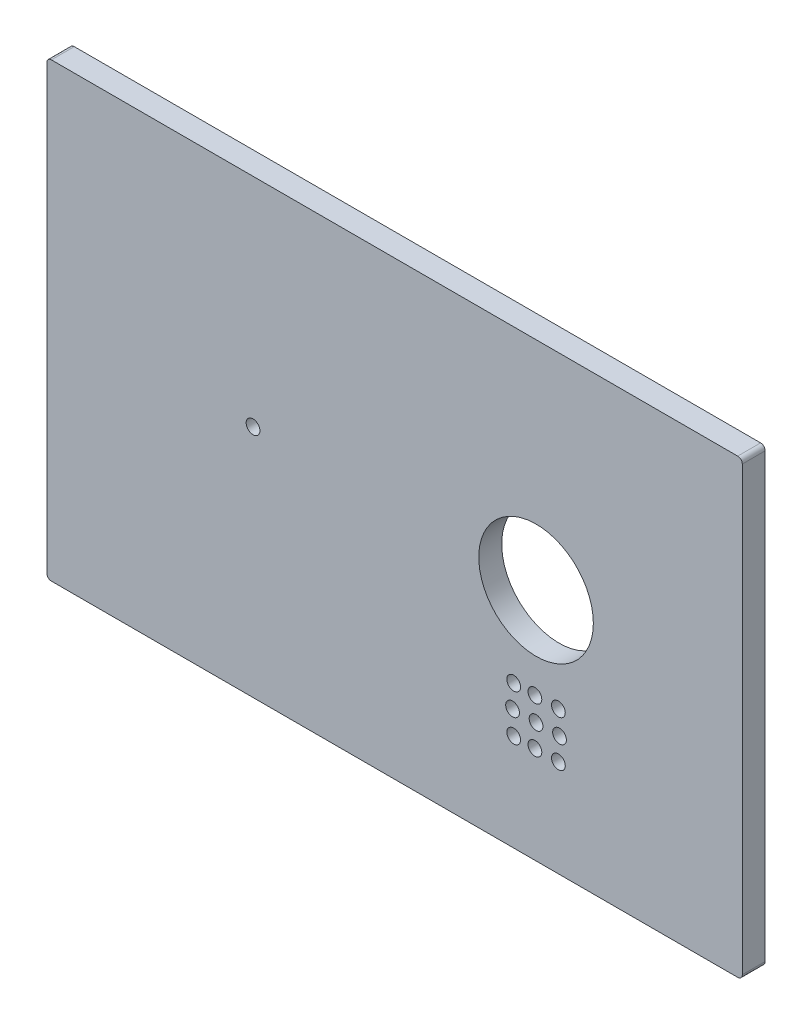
ISO-10303-21;
HEADER;
FILE_DESCRIPTION(('STEP AP214'),'2;1');
FILE_NAME('part.step','',(''),(''),'','','');
FILE_SCHEMA(('AUTOMOTIVE_DESIGN { 1 0 10303 214 1 1 1 1 }'));
ENDSEC;
DATA;
#1=APPLICATION_CONTEXT('core data for automotive mechanical design processes');
#2=APPLICATION_PROTOCOL_DEFINITION('international standard','automotive_design',2000,#1);
#3=PRODUCT_CONTEXT('',#1,'mechanical');
#4=PRODUCT('Part','Part','',(#3));
#5=PRODUCT_RELATED_PRODUCT_CATEGORY('part','',(#4));
#6=PRODUCT_DEFINITION_FORMATION('','',#4);
#7=PRODUCT_DEFINITION_CONTEXT('part definition',#1,'design');
#8=PRODUCT_DEFINITION('design','',#6,#7);
#9=PRODUCT_DEFINITION_SHAPE('','',#8);
#10=(LENGTH_UNIT() NAMED_UNIT(*) SI_UNIT(.MILLI.,.METRE.));
#11=(NAMED_UNIT(*) PLANE_ANGLE_UNIT() SI_UNIT($,.RADIAN.));
#12=(NAMED_UNIT(*) SI_UNIT($,.STERADIAN.) SOLID_ANGLE_UNIT());
#13=UNCERTAINTY_MEASURE_WITH_UNIT(LENGTH_MEASURE(1.E-05),#10,'distance_accuracy_value','');
#14=(GEOMETRIC_REPRESENTATION_CONTEXT(3) GLOBAL_UNCERTAINTY_ASSIGNED_CONTEXT((#13)) GLOBAL_UNIT_ASSIGNED_CONTEXT((#10,
#11,#12)) REPRESENTATION_CONTEXT('',''));
#15=CARTESIAN_POINT('',(0.,0.,0.));
#16=DIRECTION('',(0.,0.,1.));
#17=DIRECTION('',(1.,0.,0.));
#18=AXIS2_PLACEMENT_3D('',#15,#16,#17);
#19=CARTESIAN_POINT('',(149.75,31.,10.));
#20=DIRECTION('',(0.,0.,-1.));
#21=DIRECTION('',(-1.,0.,0.));
#22=AXIS2_PLACEMENT_3D('',#19,#20,#21);
#23=CYLINDRICAL_SURFACE('',#22,2.);
#24=CARTESIAN_POINT('',(149.75,31.,0.));
#25=DIRECTION('',(0.,0.,1.));
#26=DIRECTION('',(1.,0.,0.));
#27=AXIS2_PLACEMENT_3D('',#24,#25,#26);
#28=CIRCLE('',#27,2.);
#29=CARTESIAN_POINT('',(149.75,29.,0.));
#30=VERTEX_POINT('',#29);
#31=CARTESIAN_POINT('',(151.75,31.,0.));
#32=VERTEX_POINT('',#31);
#33=EDGE_CURVE('E127',#30,#32,#28,.T.);
#34=ORIENTED_EDGE('',*,*,#33,.T.);
#35=DIRECTION('',(0.,0.,-1.));
#36=VECTOR('',#35,1.);
#37=CARTESIAN_POINT('',(151.75,31.,10.));
#38=LINE('',#37,#36);
#39=CARTESIAN_POINT('',(151.75,31.,10.));
#40=VERTEX_POINT('',#39);
#41=EDGE_CURVE('E11',#40,#32,#38,.T.);
#42=ORIENTED_EDGE('',*,*,#41,.F.);
#43=CARTESIAN_POINT('',(149.75,31.,10.));
#44=DIRECTION('',(0.,0.,1.));
#45=DIRECTION('',(1.,0.,0.));
#46=AXIS2_PLACEMENT_3D('',#43,#44,#45);
#47=CIRCLE('',#46,2.);
#48=CARTESIAN_POINT('',(149.75,29.,10.));
#49=VERTEX_POINT('',#48);
#50=EDGE_CURVE('E143',#49,#40,#47,.T.);
#51=ORIENTED_EDGE('',*,*,#50,.F.);
#52=DIRECTION('',(0.,0.,-1.));
#53=VECTOR('',#52,1.);
#54=CARTESIAN_POINT('',(149.75,29.,10.));
#55=LINE('',#54,#53);
#56=EDGE_CURVE('E123',#49,#30,#55,.T.);
#57=ORIENTED_EDGE('',*,*,#56,.T.);
#58=EDGE_LOOP('',(#34,#42,#51,#57));
#59=FACE_BOUND('',#58,.T.);
#60=ADVANCED_FACE('F32',(#59),#23,.T.);
#61=CARTESIAN_POINT('',(151.75,224.,10.));
#62=DIRECTION('',(-1.,0.,0.));
#63=DIRECTION('',(0.,0.,1.));
#64=AXIS2_PLACEMENT_3D('',#61,#62,#63);
#65=PLANE('',#64);
#66=DIRECTION('',(0.,1.,0.));
#67=VECTOR('',#66,1.);
#68=CARTESIAN_POINT('',(151.75,224.,0.));
#69=LINE('',#68,#67);
#70=CARTESIAN_POINT('',(151.75,224.,0.));
#71=VERTEX_POINT('',#70);
#72=EDGE_CURVE('E130',#32,#71,#69,.T.);
#73=ORIENTED_EDGE('',*,*,#72,.T.);
#74=DIRECTION('',(0.,0.,-1.));
#75=VECTOR('',#74,1.);
#76=CARTESIAN_POINT('',(151.75,224.,10.));
#77=LINE('',#76,#75);
#78=CARTESIAN_POINT('',(151.75,224.,10.));
#79=VERTEX_POINT('',#78);
#80=EDGE_CURVE('E40',#79,#71,#77,.T.);
#81=ORIENTED_EDGE('',*,*,#80,.F.);
#82=DIRECTION('',(0.,1.,0.));
#83=VECTOR('',#82,1.);
#84=CARTESIAN_POINT('',(151.75,74.6881003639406,10.));
#85=LINE('',#84,#83);
#86=EDGE_CURVE('E91',#40,#79,#85,.T.);
#87=ORIENTED_EDGE('',*,*,#86,.F.);
#88=ORIENTED_EDGE('',*,*,#41,.T.);
#89=EDGE_LOOP('',(#73,#81,#87,#88));
#90=FACE_BOUND('',#89,.T.);
#91=ADVANCED_FACE('F290',(#90),#65,.F.);
#92=CARTESIAN_POINT('',(149.75,224.,10.));
#93=DIRECTION('',(0.,0.,-1.));
#94=DIRECTION('',(-1.,0.,0.));
#95=AXIS2_PLACEMENT_3D('',#92,#93,#94);
#96=CYLINDRICAL_SURFACE('',#95,2.);
#97=CARTESIAN_POINT('',(149.75,224.,0.));
#98=DIRECTION('',(0.,0.,1.));
#99=DIRECTION('',(-1.,0.,0.));
#100=AXIS2_PLACEMENT_3D('',#97,#98,#99);
#101=CIRCLE('',#100,2.);
#102=CARTESIAN_POINT('',(149.75,226.,0.));
#103=VERTEX_POINT('',#102);
#104=EDGE_CURVE('E133',#71,#103,#101,.T.);
#105=ORIENTED_EDGE('',*,*,#104,.T.);
#106=DIRECTION('',(0.,0.,-1.));
#107=VECTOR('',#106,1.);
#108=CARTESIAN_POINT('',(149.75,226.,10.));
#109=LINE('',#108,#107);
#110=CARTESIAN_POINT('',(149.75,226.,10.));
#111=VERTEX_POINT('',#110);
#112=EDGE_CURVE('E150',#111,#103,#109,.T.);
#113=ORIENTED_EDGE('',*,*,#112,.F.);
#114=CARTESIAN_POINT('',(149.75,224.,10.));
#115=DIRECTION('',(0.,0.,1.));
#116=DIRECTION('',(-1.,0.,0.));
#117=AXIS2_PLACEMENT_3D('',#114,#115,#116);
#118=CIRCLE('',#117,2.);
#119=EDGE_CURVE('E158',#79,#111,#118,.T.);
#120=ORIENTED_EDGE('',*,*,#119,.F.);
#121=ORIENTED_EDGE('',*,*,#80,.T.);
#122=EDGE_LOOP('',(#105,#113,#120,#121));
#123=FACE_BOUND('',#122,.T.);
#124=ADVANCED_FACE('F156',(#123),#96,.T.);
#125=CARTESIAN_POINT('',(-149.75,226.,10.));
#126=DIRECTION('',(0.,-1.,0.));
#127=DIRECTION('',(1.,0.,0.));
#128=AXIS2_PLACEMENT_3D('',#125,#126,#127);
#129=PLANE('',#128);
#130=DIRECTION('',(-1.,0.,0.));
#131=VECTOR('',#130,1.);
#132=CARTESIAN_POINT('',(-149.75,226.,0.));
#133=LINE('',#132,#131);
#134=CARTESIAN_POINT('',(-149.75,226.,0.));
#135=VERTEX_POINT('',#134);
#136=EDGE_CURVE('E135',#103,#135,#133,.T.);
#137=ORIENTED_EDGE('',*,*,#136,.T.);
#138=DIRECTION('',(0.,0.,-1.));
#139=VECTOR('',#138,1.);
#140=CARTESIAN_POINT('',(-149.75,226.,10.));
#141=LINE('',#140,#139);
#142=CARTESIAN_POINT('',(-149.75,226.,10.));
#143=VERTEX_POINT('',#142);
#144=EDGE_CURVE('E147',#143,#135,#141,.T.);
#145=ORIENTED_EDGE('',*,*,#144,.F.);
#146=DIRECTION('',(-1.,0.,0.));
#147=VECTOR('',#146,1.);
#148=CARTESIAN_POINT('',(-149.75,226.,10.));
#149=LINE('',#148,#147);
#150=EDGE_CURVE('E170',#111,#143,#149,.T.);
#151=ORIENTED_EDGE('',*,*,#150,.F.);
#152=ORIENTED_EDGE('',*,*,#112,.T.);
#153=EDGE_LOOP('',(#137,#145,#151,#152));
#154=FACE_BOUND('',#153,.T.);
#155=ADVANCED_FACE('F166',(#154),#129,.F.);
#156=CARTESIAN_POINT('',(-149.75,224.,10.));
#157=DIRECTION('',(0.,0.,-1.));
#158=DIRECTION('',(-1.,0.,0.));
#159=AXIS2_PLACEMENT_3D('',#156,#157,#158);
#160=CYLINDRICAL_SURFACE('',#159,2.);
#161=CARTESIAN_POINT('',(-149.75,224.,0.));
#162=DIRECTION('',(0.,0.,1.));
#163=DIRECTION('',(1.,0.,0.));
#164=AXIS2_PLACEMENT_3D('',#161,#162,#163);
#165=CIRCLE('',#164,2.);
#166=CARTESIAN_POINT('',(-151.75,224.,0.));
#167=VERTEX_POINT('',#166);
#168=EDGE_CURVE('E137',#135,#167,#165,.T.);
#169=ORIENTED_EDGE('',*,*,#168,.T.);
#170=DIRECTION('',(0.,0.,-1.));
#171=VECTOR('',#170,1.);
#172=CARTESIAN_POINT('',(-151.75,224.,10.));
#173=LINE('',#172,#171);
#174=CARTESIAN_POINT('',(-151.75,224.,10.));
#175=VERTEX_POINT('',#174);
#176=EDGE_CURVE('E118',#175,#167,#173,.T.);
#177=ORIENTED_EDGE('',*,*,#176,.F.);
#178=CARTESIAN_POINT('',(-149.75,224.,10.));
#179=DIRECTION('',(0.,0.,1.));
#180=DIRECTION('',(1.,0.,0.));
#181=AXIS2_PLACEMENT_3D('',#178,#179,#180);
#182=CIRCLE('',#181,2.);
#183=EDGE_CURVE('E110',#143,#175,#182,.T.);
#184=ORIENTED_EDGE('',*,*,#183,.F.);
#185=ORIENTED_EDGE('',*,*,#144,.T.);
#186=EDGE_LOOP('',(#169,#177,#184,#185));
#187=FACE_BOUND('',#186,.T.);
#188=ADVANCED_FACE('F169',(#187),#160,.T.);
#189=CARTESIAN_POINT('',(-151.75,74.6881003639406,10.));
#190=DIRECTION('',(1.,0.,0.));
#191=DIRECTION('',(0.,0.,-1.));
#192=AXIS2_PLACEMENT_3D('',#189,#190,#191);
#193=PLANE('',#192);
#194=DIRECTION('',(0.,-1.,0.));
#195=VECTOR('',#194,1.);
#196=CARTESIAN_POINT('',(-151.75,74.6881003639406,0.));
#197=LINE('',#196,#195);
#198=CARTESIAN_POINT('',(-151.75,31.,0.));
#199=VERTEX_POINT('',#198);
#200=EDGE_CURVE('E117',#167,#199,#197,.T.);
#201=ORIENTED_EDGE('',*,*,#200,.T.);
#202=DIRECTION('',(0.,0.,-1.));
#203=VECTOR('',#202,1.);
#204=CARTESIAN_POINT('',(-151.75,31.,10.));
#205=LINE('',#204,#203);
#206=CARTESIAN_POINT('',(-151.75,31.,10.));
#207=VERTEX_POINT('',#206);
#208=EDGE_CURVE('E115',#207,#199,#205,.T.);
#209=ORIENTED_EDGE('',*,*,#208,.F.);
#210=DIRECTION('',(0.,-1.,0.));
#211=VECTOR('',#210,1.);
#212=CARTESIAN_POINT('',(-151.75,224.,10.));
#213=LINE('',#212,#211);
#214=EDGE_CURVE('E104',#175,#207,#213,.T.);
#215=ORIENTED_EDGE('',*,*,#214,.F.);
#216=ORIENTED_EDGE('',*,*,#176,.T.);
#217=EDGE_LOOP('',(#201,#209,#215,#216));
#218=FACE_BOUND('',#217,.T.);
#219=ADVANCED_FACE('F116',(#218),#193,.F.);
#220=CARTESIAN_POINT('',(-149.75,31.,10.));
#221=DIRECTION('',(0.,0.,-1.));
#222=DIRECTION('',(-1.,0.,0.));
#223=AXIS2_PLACEMENT_3D('',#220,#221,#222);
#224=CYLINDRICAL_SURFACE('',#223,2.);
#225=CARTESIAN_POINT('',(-149.75,31.,0.));
#226=DIRECTION('',(0.,0.,1.));
#227=DIRECTION('',(-1.,0.,0.));
#228=AXIS2_PLACEMENT_3D('',#225,#226,#227);
#229=CIRCLE('',#228,2.);
#230=CARTESIAN_POINT('',(-149.75,29.,0.));
#231=VERTEX_POINT('',#230);
#232=EDGE_CURVE('E77',#199,#231,#229,.T.);
#233=ORIENTED_EDGE('',*,*,#232,.T.);
#234=DIRECTION('',(0.,0.,-1.));
#235=VECTOR('',#234,1.);
#236=CARTESIAN_POINT('',(-149.75,29.,10.));
#237=LINE('',#236,#235);
#238=CARTESIAN_POINT('',(-149.75,29.,10.));
#239=VERTEX_POINT('',#238);
#240=EDGE_CURVE('E119',#239,#231,#237,.T.);
#241=ORIENTED_EDGE('',*,*,#240,.F.);
#242=CARTESIAN_POINT('',(-149.75,31.,10.));
#243=DIRECTION('',(0.,0.,1.));
#244=DIRECTION('',(-1.,0.,0.));
#245=AXIS2_PLACEMENT_3D('',#242,#243,#244);
#246=CIRCLE('',#245,2.);
#247=EDGE_CURVE('E108',#207,#239,#246,.T.);
#248=ORIENTED_EDGE('',*,*,#247,.F.);
#249=ORIENTED_EDGE('',*,*,#208,.T.);
#250=EDGE_LOOP('',(#233,#241,#248,#249));
#251=FACE_BOUND('',#250,.T.);
#252=ADVANCED_FACE('F121',(#251),#224,.T.);
#253=CARTESIAN_POINT('',(-149.75,29.,10.));
#254=DIRECTION('',(0.,1.,0.));
#255=DIRECTION('',(-1.,0.,0.));
#256=AXIS2_PLACEMENT_3D('',#253,#254,#255);
#257=PLANE('',#256);
#258=DIRECTION('',(1.,0.,0.));
#259=VECTOR('',#258,1.);
#260=CARTESIAN_POINT('',(-149.75,29.,0.));
#261=LINE('',#260,#259);
#262=EDGE_CURVE('E83',#231,#30,#261,.T.);
#263=ORIENTED_EDGE('',*,*,#262,.T.);
#264=ORIENTED_EDGE('',*,*,#56,.F.);
#265=DIRECTION('',(1.,0.,0.));
#266=VECTOR('',#265,1.);
#267=CARTESIAN_POINT('',(-149.75,29.,10.));
#268=LINE('',#267,#266);
#269=EDGE_CURVE('E48',#239,#49,#268,.T.);
#270=ORIENTED_EDGE('',*,*,#269,.F.);
#271=ORIENTED_EDGE('',*,*,#240,.T.);
#272=EDGE_LOOP('',(#263,#264,#270,#271));
#273=FACE_BOUND('',#272,.T.);
#274=ADVANCED_FACE('F253',(#273),#257,.F.);
#275=CARTESIAN_POINT('',(149.75,31.,10.));
#276=DIRECTION('',(0.,0.,1.));
#277=DIRECTION('',(1.,0.,0.));
#278=AXIS2_PLACEMENT_3D('',#275,#276,#277);
#279=PLANE('',#278);
#280=CARTESIAN_POINT('',(61.75,131.327177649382,10.));
#281=DIRECTION('',(0.,0.,1.));
#282=DIRECTION('',(1.,0.,0.));
#283=AXIS2_PLACEMENT_3D('',#280,#281,#282);
#284=CIRCLE('',#283,25.);
#285=CARTESIAN_POINT('',(86.75,131.327177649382,10.));
#286=VERTEX_POINT('',#285);
#287=EDGE_CURVE('E236',#286,#286,#284,.T.);
#288=ORIENTED_EDGE('',*,*,#287,.F.);
#289=EDGE_LOOP('',(#288));
#290=FACE_BOUND('',#289,.T.);
#291=CARTESIAN_POINT('',(61.2499999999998,71.3271776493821,10.));
#292=DIRECTION('',(0.,0.,1.));
#293=DIRECTION('',(-1.,0.,0.));
#294=AXIS2_PLACEMENT_3D('',#291,#292,#293);
#295=CIRCLE('',#294,3.00000000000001);
#296=CARTESIAN_POINT('',(58.2499999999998,71.3271776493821,10.));
#297=VERTEX_POINT('',#296);
#298=EDGE_CURVE('E230',#297,#297,#295,.T.);
#299=ORIENTED_EDGE('',*,*,#298,.F.);
#300=EDGE_LOOP('',(#299));
#301=FACE_BOUND('',#300,.T.);
#302=CARTESIAN_POINT('',(52.0000000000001,71.3271776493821,10.));
#303=DIRECTION('',(0.,0.,1.));
#304=DIRECTION('',(1.,0.,0.));
#305=AXIS2_PLACEMENT_3D('',#302,#303,#304);
#306=CIRCLE('',#305,3.);
#307=CARTESIAN_POINT('',(55.0000000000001,71.3271776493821,10.));
#308=VERTEX_POINT('',#307);
#309=EDGE_CURVE('E224',#308,#308,#306,.T.);
#310=ORIENTED_EDGE('',*,*,#309,.F.);
#311=EDGE_LOOP('',(#310));
#312=FACE_BOUND('',#311,.T.);
#313=CARTESIAN_POINT('',(71.4999999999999,71.3271776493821,10.));
#314=DIRECTION('',(0.,0.,1.));
#315=DIRECTION('',(-1.,0.,0.));
#316=AXIS2_PLACEMENT_3D('',#313,#314,#315);
#317=CIRCLE('',#316,3.00000000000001);
#318=CARTESIAN_POINT('',(68.4999999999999,71.3271776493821,10.));
#319=VERTEX_POINT('',#318);
#320=EDGE_CURVE('E218',#319,#319,#317,.T.);
#321=ORIENTED_EDGE('',*,*,#320,.F.);
#322=EDGE_LOOP('',(#321));
#323=FACE_BOUND('',#322,.T.);
#324=CARTESIAN_POINT('',(51.4999999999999,81.3271776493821,10.));
#325=DIRECTION('',(0.,0.,1.));
#326=DIRECTION('',(-1.,0.,0.));
#327=AXIS2_PLACEMENT_3D('',#324,#325,#326);
#328=CIRCLE('',#327,3.);
#329=CARTESIAN_POINT('',(48.4999999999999,81.3271776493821,10.));
#330=VERTEX_POINT('',#329);
#331=EDGE_CURVE('E212',#330,#330,#328,.T.);
#332=ORIENTED_EDGE('',*,*,#331,.F.);
#333=EDGE_LOOP('',(#332));
#334=FACE_BOUND('',#333,.T.);
#335=CARTESIAN_POINT('',(71.4999999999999,91.3271776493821,10.));
#336=DIRECTION('',(0.,0.,1.));
#337=DIRECTION('',(1.,0.,0.));
#338=AXIS2_PLACEMENT_3D('',#335,#336,#337);
#339=CIRCLE('',#338,3.00000000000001);
#340=CARTESIAN_POINT('',(74.4999999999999,91.3271776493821,10.));
#341=VERTEX_POINT('',#340);
#342=EDGE_CURVE('E206',#341,#341,#339,.T.);
#343=ORIENTED_EDGE('',*,*,#342,.F.);
#344=EDGE_LOOP('',(#343));
#345=FACE_BOUND('',#344,.T.);
#346=CARTESIAN_POINT('',(61.2499999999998,91.3271776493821,10.));
#347=DIRECTION('',(0.,0.,1.));
#348=DIRECTION('',(1.,0.,0.));
#349=AXIS2_PLACEMENT_3D('',#346,#347,#348);
#350=CIRCLE('',#349,3.00000000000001);
#351=CARTESIAN_POINT('',(64.2499999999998,91.3271776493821,10.));
#352=VERTEX_POINT('',#351);
#353=EDGE_CURVE('E200',#352,#352,#350,.T.);
#354=ORIENTED_EDGE('',*,*,#353,.F.);
#355=EDGE_LOOP('',(#354));
#356=FACE_BOUND('',#355,.T.);
#357=CARTESIAN_POINT('',(72.0000000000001,81.3271776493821,10.));
#358=DIRECTION('',(0.,0.,1.));
#359=DIRECTION('',(1.,0.,0.));
#360=AXIS2_PLACEMENT_3D('',#357,#358,#359);
#361=CIRCLE('',#360,3.00000000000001);
#362=CARTESIAN_POINT('',(75.0000000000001,81.3271776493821,10.));
#363=VERTEX_POINT('',#362);
#364=EDGE_CURVE('E194',#363,#363,#361,.T.);
#365=ORIENTED_EDGE('',*,*,#364,.F.);
#366=EDGE_LOOP('',(#365));
#367=FACE_BOUND('',#366,.T.);
#368=CARTESIAN_POINT('',(52.0000000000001,91.3271776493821,10.));
#369=DIRECTION('',(0.,0.,1.));
#370=DIRECTION('',(-1.,0.,0.));
#371=AXIS2_PLACEMENT_3D('',#368,#369,#370);
#372=CIRCLE('',#371,3.);
#373=CARTESIAN_POINT('',(49.0000000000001,91.3271776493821,10.));
#374=VERTEX_POINT('',#373);
#375=EDGE_CURVE('E188',#374,#374,#372,.T.);
#376=ORIENTED_EDGE('',*,*,#375,.F.);
#377=EDGE_LOOP('',(#376));
#378=FACE_BOUND('',#377,.T.);
#379=CARTESIAN_POINT('',(61.75,81.3271776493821,10.));
#380=DIRECTION('',(0.,0.,1.));
#381=DIRECTION('',(1.,0.,0.));
#382=AXIS2_PLACEMENT_3D('',#379,#380,#381);
#383=CIRCLE('',#382,3.);
#384=CARTESIAN_POINT('',(64.75,81.3271776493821,10.));
#385=VERTEX_POINT('',#384);
#386=EDGE_CURVE('E182',#385,#385,#383,.T.);
#387=ORIENTED_EDGE('',*,*,#386,.F.);
#388=EDGE_LOOP('',(#387));
#389=FACE_BOUND('',#388,.T.);
#390=CARTESIAN_POINT('',(-61.75,131.327177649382,10.));
#391=DIRECTION('',(0.,0.,1.));
#392=DIRECTION('',(1.,0.,0.));
#393=AXIS2_PLACEMENT_3D('',#390,#391,#392);
#394=CIRCLE('',#393,3.);
#395=CARTESIAN_POINT('',(-58.75,131.327177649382,10.));
#396=VERTEX_POINT('',#395);
#397=EDGE_CURVE('E176',#396,#396,#394,.T.);
#398=ORIENTED_EDGE('',*,*,#397,.F.);
#399=EDGE_LOOP('',(#398));
#400=FACE_BOUND('',#399,.T.);
#401=ORIENTED_EDGE('',*,*,#50,.T.);
#402=ORIENTED_EDGE('',*,*,#86,.T.);
#403=ORIENTED_EDGE('',*,*,#119,.T.);
#404=ORIENTED_EDGE('',*,*,#150,.T.);
#405=ORIENTED_EDGE('',*,*,#183,.T.);
#406=ORIENTED_EDGE('',*,*,#214,.T.);
#407=ORIENTED_EDGE('',*,*,#247,.T.);
#408=ORIENTED_EDGE('',*,*,#269,.T.);
#409=EDGE_LOOP('',(#401,#402,#403,#404,#405,#406,#407,#408));
#410=FACE_BOUND('',#409,.T.);
#411=ADVANCED_FACE('F106',(#290,#301,#312,#323,#334,#345,#356,#367,#378,#389,#400,#410),#279,.T.);
#412=CARTESIAN_POINT('',(149.75,31.,0.));
#413=DIRECTION('',(0.,0.,1.));
#414=DIRECTION('',(1.,0.,0.));
#415=AXIS2_PLACEMENT_3D('',#412,#413,#414);
#416=PLANE('',#415);
#417=CARTESIAN_POINT('',(61.75,131.327177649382,0.));
#418=DIRECTION('',(0.,0.,1.));
#419=DIRECTION('',(1.,0.,0.));
#420=AXIS2_PLACEMENT_3D('',#417,#418,#419);
#421=CIRCLE('',#420,25.);
#422=CARTESIAN_POINT('',(86.75,131.327177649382,0.));
#423=VERTEX_POINT('',#422);
#424=EDGE_CURVE('E233',#423,#423,#421,.T.);
#425=ORIENTED_EDGE('',*,*,#424,.T.);
#426=EDGE_LOOP('',(#425));
#427=FACE_BOUND('',#426,.T.);
#428=CARTESIAN_POINT('',(61.2499999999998,71.3271776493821,0.));
#429=DIRECTION('',(0.,0.,1.));
#430=DIRECTION('',(-1.,0.,0.));
#431=AXIS2_PLACEMENT_3D('',#428,#429,#430);
#432=CIRCLE('',#431,3.00000000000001);
#433=CARTESIAN_POINT('',(58.2499999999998,71.3271776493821,0.));
#434=VERTEX_POINT('',#433);
#435=EDGE_CURVE('E227',#434,#434,#432,.T.);
#436=ORIENTED_EDGE('',*,*,#435,.T.);
#437=EDGE_LOOP('',(#436));
#438=FACE_BOUND('',#437,.T.);
#439=CARTESIAN_POINT('',(52.0000000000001,71.3271776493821,0.));
#440=DIRECTION('',(0.,0.,1.));
#441=DIRECTION('',(1.,0.,0.));
#442=AXIS2_PLACEMENT_3D('',#439,#440,#441);
#443=CIRCLE('',#442,3.);
#444=CARTESIAN_POINT('',(55.0000000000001,71.3271776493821,0.));
#445=VERTEX_POINT('',#444);
#446=EDGE_CURVE('E221',#445,#445,#443,.T.);
#447=ORIENTED_EDGE('',*,*,#446,.T.);
#448=EDGE_LOOP('',(#447));
#449=FACE_BOUND('',#448,.T.);
#450=CARTESIAN_POINT('',(71.4999999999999,71.3271776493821,0.));
#451=DIRECTION('',(0.,0.,1.));
#452=DIRECTION('',(-1.,0.,0.));
#453=AXIS2_PLACEMENT_3D('',#450,#451,#452);
#454=CIRCLE('',#453,3.00000000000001);
#455=CARTESIAN_POINT('',(68.4999999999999,71.3271776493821,0.));
#456=VERTEX_POINT('',#455);
#457=EDGE_CURVE('E215',#456,#456,#454,.T.);
#458=ORIENTED_EDGE('',*,*,#457,.T.);
#459=EDGE_LOOP('',(#458));
#460=FACE_BOUND('',#459,.T.);
#461=CARTESIAN_POINT('',(51.4999999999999,81.3271776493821,0.));
#462=DIRECTION('',(0.,0.,1.));
#463=DIRECTION('',(-1.,0.,0.));
#464=AXIS2_PLACEMENT_3D('',#461,#462,#463);
#465=CIRCLE('',#464,3.);
#466=CARTESIAN_POINT('',(48.4999999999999,81.3271776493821,0.));
#467=VERTEX_POINT('',#466);
#468=EDGE_CURVE('E209',#467,#467,#465,.T.);
#469=ORIENTED_EDGE('',*,*,#468,.T.);
#470=EDGE_LOOP('',(#469));
#471=FACE_BOUND('',#470,.T.);
#472=CARTESIAN_POINT('',(71.4999999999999,91.3271776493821,0.));
#473=DIRECTION('',(0.,0.,1.));
#474=DIRECTION('',(1.,0.,0.));
#475=AXIS2_PLACEMENT_3D('',#472,#473,#474);
#476=CIRCLE('',#475,3.00000000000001);
#477=CARTESIAN_POINT('',(74.4999999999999,91.3271776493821,0.));
#478=VERTEX_POINT('',#477);
#479=EDGE_CURVE('E203',#478,#478,#476,.T.);
#480=ORIENTED_EDGE('',*,*,#479,.T.);
#481=EDGE_LOOP('',(#480));
#482=FACE_BOUND('',#481,.T.);
#483=CARTESIAN_POINT('',(61.2499999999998,91.3271776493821,0.));
#484=DIRECTION('',(0.,0.,1.));
#485=DIRECTION('',(1.,0.,0.));
#486=AXIS2_PLACEMENT_3D('',#483,#484,#485);
#487=CIRCLE('',#486,3.00000000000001);
#488=CARTESIAN_POINT('',(64.2499999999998,91.3271776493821,0.));
#489=VERTEX_POINT('',#488);
#490=EDGE_CURVE('E197',#489,#489,#487,.T.);
#491=ORIENTED_EDGE('',*,*,#490,.T.);
#492=EDGE_LOOP('',(#491));
#493=FACE_BOUND('',#492,.T.);
#494=CARTESIAN_POINT('',(72.0000000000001,81.3271776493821,0.));
#495=DIRECTION('',(0.,0.,1.));
#496=DIRECTION('',(1.,0.,0.));
#497=AXIS2_PLACEMENT_3D('',#494,#495,#496);
#498=CIRCLE('',#497,3.00000000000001);
#499=CARTESIAN_POINT('',(75.0000000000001,81.3271776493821,0.));
#500=VERTEX_POINT('',#499);
#501=EDGE_CURVE('E191',#500,#500,#498,.T.);
#502=ORIENTED_EDGE('',*,*,#501,.T.);
#503=EDGE_LOOP('',(#502));
#504=FACE_BOUND('',#503,.T.);
#505=CARTESIAN_POINT('',(52.0000000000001,91.3271776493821,0.));
#506=DIRECTION('',(0.,0.,1.));
#507=DIRECTION('',(-1.,0.,0.));
#508=AXIS2_PLACEMENT_3D('',#505,#506,#507);
#509=CIRCLE('',#508,3.);
#510=CARTESIAN_POINT('',(49.0000000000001,91.3271776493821,0.));
#511=VERTEX_POINT('',#510);
#512=EDGE_CURVE('E185',#511,#511,#509,.T.);
#513=ORIENTED_EDGE('',*,*,#512,.T.);
#514=EDGE_LOOP('',(#513));
#515=FACE_BOUND('',#514,.T.);
#516=CARTESIAN_POINT('',(61.75,81.3271776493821,0.));
#517=DIRECTION('',(0.,0.,1.));
#518=DIRECTION('',(1.,0.,0.));
#519=AXIS2_PLACEMENT_3D('',#516,#517,#518);
#520=CIRCLE('',#519,3.);
#521=CARTESIAN_POINT('',(64.75,81.3271776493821,0.));
#522=VERTEX_POINT('',#521);
#523=EDGE_CURVE('E179',#522,#522,#520,.T.);
#524=ORIENTED_EDGE('',*,*,#523,.T.);
#525=EDGE_LOOP('',(#524));
#526=FACE_BOUND('',#525,.T.);
#527=CARTESIAN_POINT('',(-61.75,131.327177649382,0.));
#528=DIRECTION('',(0.,0.,1.));
#529=DIRECTION('',(1.,0.,0.));
#530=AXIS2_PLACEMENT_3D('',#527,#528,#529);
#531=CIRCLE('',#530,3.);
#532=CARTESIAN_POINT('',(-58.75,131.327177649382,0.));
#533=VERTEX_POINT('',#532);
#534=EDGE_CURVE('E131',#533,#533,#531,.T.);
#535=ORIENTED_EDGE('',*,*,#534,.T.);
#536=EDGE_LOOP('',(#535));
#537=FACE_BOUND('',#536,.T.);
#538=ORIENTED_EDGE('',*,*,#33,.F.);
#539=ORIENTED_EDGE('',*,*,#262,.F.);
#540=ORIENTED_EDGE('',*,*,#232,.F.);
#541=ORIENTED_EDGE('',*,*,#200,.F.);
#542=ORIENTED_EDGE('',*,*,#168,.F.);
#543=ORIENTED_EDGE('',*,*,#136,.F.);
#544=ORIENTED_EDGE('',*,*,#104,.F.);
#545=ORIENTED_EDGE('',*,*,#72,.F.);
#546=EDGE_LOOP('',(#538,#539,#540,#541,#542,#543,#544,#545));
#547=FACE_BOUND('',#546,.T.);
#548=ADVANCED_FACE('F162',(#427,#438,#449,#460,#471,#482,#493,#504,#515,#526,#537,#547),#416,.F.);
#549=CARTESIAN_POINT('',(-61.75,131.327177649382,0.));
#550=DIRECTION('',(0.,0.,1.));
#551=DIRECTION('',(1.,0.,0.));
#552=AXIS2_PLACEMENT_3D('',#549,#550,#551);
#553=CYLINDRICAL_SURFACE('',#552,3.);
#554=ORIENTED_EDGE('',*,*,#534,.F.);
#555=EDGE_LOOP('',(#554));
#556=FACE_BOUND('',#555,.T.);
#557=ORIENTED_EDGE('',*,*,#397,.T.);
#558=EDGE_LOOP('',(#557));
#559=FACE_BOUND('',#558,.T.);
#560=ADVANCED_FACE('F275',(#556,#559),#553,.F.);
#561=CARTESIAN_POINT('',(61.75,81.3271776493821,0.));
#562=DIRECTION('',(0.,0.,1.));
#563=DIRECTION('',(1.,0.,0.));
#564=AXIS2_PLACEMENT_3D('',#561,#562,#563);
#565=CYLINDRICAL_SURFACE('',#564,3.);
#566=ORIENTED_EDGE('',*,*,#523,.F.);
#567=EDGE_LOOP('',(#566));
#568=FACE_BOUND('',#567,.T.);
#569=ORIENTED_EDGE('',*,*,#386,.T.);
#570=EDGE_LOOP('',(#569));
#571=FACE_BOUND('',#570,.T.);
#572=ADVANCED_FACE('F277',(#568,#571),#565,.F.);
#573=CARTESIAN_POINT('',(52.0000000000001,91.3271776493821,0.));
#574=DIRECTION('',(0.,0.,1.));
#575=DIRECTION('',(1.,0.,0.));
#576=AXIS2_PLACEMENT_3D('',#573,#574,#575);
#577=CYLINDRICAL_SURFACE('',#576,3.);
#578=ORIENTED_EDGE('',*,*,#512,.F.);
#579=EDGE_LOOP('',(#578));
#580=FACE_BOUND('',#579,.T.);
#581=ORIENTED_EDGE('',*,*,#375,.T.);
#582=EDGE_LOOP('',(#581));
#583=FACE_BOUND('',#582,.T.);
#584=ADVANCED_FACE('F284',(#580,#583),#577,.F.);
#585=CARTESIAN_POINT('',(72.0000000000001,81.3271776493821,0.));
#586=DIRECTION('',(0.,0.,1.));
#587=DIRECTION('',(1.,0.,0.));
#588=AXIS2_PLACEMENT_3D('',#585,#586,#587);
#589=CYLINDRICAL_SURFACE('',#588,3.00000000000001);
#590=ORIENTED_EDGE('',*,*,#501,.F.);
#591=EDGE_LOOP('',(#590));
#592=FACE_BOUND('',#591,.T.);
#593=ORIENTED_EDGE('',*,*,#364,.T.);
#594=EDGE_LOOP('',(#593));
#595=FACE_BOUND('',#594,.T.);
#596=ADVANCED_FACE('F356',(#592,#595),#589,.F.);
#597=CARTESIAN_POINT('',(61.2499999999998,91.3271776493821,0.));
#598=DIRECTION('',(0.,0.,1.));
#599=DIRECTION('',(1.,0.,0.));
#600=AXIS2_PLACEMENT_3D('',#597,#598,#599);
#601=CYLINDRICAL_SURFACE('',#600,3.00000000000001);
#602=ORIENTED_EDGE('',*,*,#490,.F.);
#603=EDGE_LOOP('',(#602));
#604=FACE_BOUND('',#603,.T.);
#605=ORIENTED_EDGE('',*,*,#353,.T.);
#606=EDGE_LOOP('',(#605));
#607=FACE_BOUND('',#606,.T.);
#608=ADVANCED_FACE('F366',(#604,#607),#601,.F.);
#609=CARTESIAN_POINT('',(71.4999999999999,91.3271776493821,0.));
#610=DIRECTION('',(0.,0.,1.));
#611=DIRECTION('',(1.,0.,0.));
#612=AXIS2_PLACEMENT_3D('',#609,#610,#611);
#613=CYLINDRICAL_SURFACE('',#612,3.00000000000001);
#614=ORIENTED_EDGE('',*,*,#479,.F.);
#615=EDGE_LOOP('',(#614));
#616=FACE_BOUND('',#615,.T.);
#617=ORIENTED_EDGE('',*,*,#342,.T.);
#618=EDGE_LOOP('',(#617));
#619=FACE_BOUND('',#618,.T.);
#620=ADVANCED_FACE('F376',(#616,#619),#613,.F.);
#621=CARTESIAN_POINT('',(51.4999999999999,81.3271776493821,0.));
#622=DIRECTION('',(0.,0.,1.));
#623=DIRECTION('',(1.,0.,0.));
#624=AXIS2_PLACEMENT_3D('',#621,#622,#623);
#625=CYLINDRICAL_SURFACE('',#624,3.);
#626=ORIENTED_EDGE('',*,*,#468,.F.);
#627=EDGE_LOOP('',(#626));
#628=FACE_BOUND('',#627,.T.);
#629=ORIENTED_EDGE('',*,*,#331,.T.);
#630=EDGE_LOOP('',(#629));
#631=FACE_BOUND('',#630,.T.);
#632=ADVANCED_FACE('F386',(#628,#631),#625,.F.);
#633=CARTESIAN_POINT('',(71.4999999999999,71.3271776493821,0.));
#634=DIRECTION('',(0.,0.,1.));
#635=DIRECTION('',(1.,0.,0.));
#636=AXIS2_PLACEMENT_3D('',#633,#634,#635);
#637=CYLINDRICAL_SURFACE('',#636,3.00000000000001);
#638=ORIENTED_EDGE('',*,*,#457,.F.);
#639=EDGE_LOOP('',(#638));
#640=FACE_BOUND('',#639,.T.);
#641=ORIENTED_EDGE('',*,*,#320,.T.);
#642=EDGE_LOOP('',(#641));
#643=FACE_BOUND('',#642,.T.);
#644=ADVANCED_FACE('F396',(#640,#643),#637,.F.);
#645=CARTESIAN_POINT('',(52.0000000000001,71.3271776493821,0.));
#646=DIRECTION('',(0.,0.,1.));
#647=DIRECTION('',(1.,0.,0.));
#648=AXIS2_PLACEMENT_3D('',#645,#646,#647);
#649=CYLINDRICAL_SURFACE('',#648,3.);
#650=ORIENTED_EDGE('',*,*,#446,.F.);
#651=EDGE_LOOP('',(#650));
#652=FACE_BOUND('',#651,.T.);
#653=ORIENTED_EDGE('',*,*,#309,.T.);
#654=EDGE_LOOP('',(#653));
#655=FACE_BOUND('',#654,.T.);
#656=ADVANCED_FACE('F406',(#652,#655),#649,.F.);
#657=CARTESIAN_POINT('',(61.2499999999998,71.3271776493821,0.));
#658=DIRECTION('',(0.,0.,1.));
#659=DIRECTION('',(1.,0.,0.));
#660=AXIS2_PLACEMENT_3D('',#657,#658,#659);
#661=CYLINDRICAL_SURFACE('',#660,3.00000000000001);
#662=ORIENTED_EDGE('',*,*,#435,.F.);
#663=EDGE_LOOP('',(#662));
#664=FACE_BOUND('',#663,.T.);
#665=ORIENTED_EDGE('',*,*,#298,.T.);
#666=EDGE_LOOP('',(#665));
#667=FACE_BOUND('',#666,.T.);
#668=ADVANCED_FACE('F247',(#664,#667),#661,.F.);
#669=CARTESIAN_POINT('',(61.75,131.327177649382,0.));
#670=DIRECTION('',(0.,0.,1.));
#671=DIRECTION('',(1.,0.,0.));
#672=AXIS2_PLACEMENT_3D('',#669,#670,#671);
#673=CYLINDRICAL_SURFACE('',#672,25.);
#674=ORIENTED_EDGE('',*,*,#424,.F.);
#675=EDGE_LOOP('',(#674));
#676=FACE_BOUND('',#675,.T.);
#677=ORIENTED_EDGE('',*,*,#287,.T.);
#678=EDGE_LOOP('',(#677));
#679=FACE_BOUND('',#678,.T.);
#680=ADVANCED_FACE('F244',(#676,#679),#673,.F.);
#681=CLOSED_SHELL('',(#60,#91,#124,#155,#188,#219,#252,#274,#411,#548,#560,#572,#584,#596,#608,
#620,#632,#644,#656,#668,#680));
#682=MANIFOLD_SOLID_BREP('B2',#681);
#683=ADVANCED_BREP_SHAPE_REPRESENTATION('',(#18,#682),#14);
#684=SHAPE_DEFINITION_REPRESENTATION(#9,#683);
ENDSEC;
END-ISO-10303-21;
